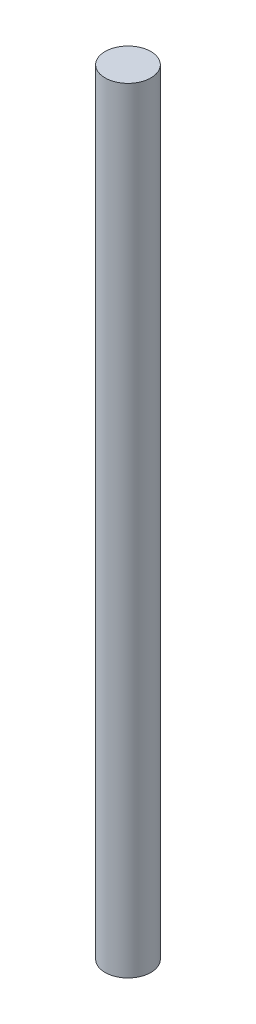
ISO-10303-21;
HEADER;
FILE_DESCRIPTION(('STEP AP214'),'2;1');
FILE_NAME('part.step','',(''),(''),'','','');
FILE_SCHEMA(('AUTOMOTIVE_DESIGN { 1 0 10303 214 1 1 1 1 }'));
ENDSEC;
DATA;
#1=APPLICATION_CONTEXT('core data for automotive mechanical design processes');
#2=APPLICATION_PROTOCOL_DEFINITION('international standard','automotive_design',2000,#1);
#3=PRODUCT_CONTEXT('',#1,'mechanical');
#4=PRODUCT('Part','Part','',(#3));
#5=PRODUCT_RELATED_PRODUCT_CATEGORY('part','',(#4));
#6=PRODUCT_DEFINITION_FORMATION('','',#4);
#7=PRODUCT_DEFINITION_CONTEXT('part definition',#1,'design');
#8=PRODUCT_DEFINITION('design','',#6,#7);
#9=PRODUCT_DEFINITION_SHAPE('','',#8);
#10=(LENGTH_UNIT() NAMED_UNIT(*) SI_UNIT(.MILLI.,.METRE.));
#11=(NAMED_UNIT(*) PLANE_ANGLE_UNIT() SI_UNIT($,.RADIAN.));
#12=(NAMED_UNIT(*) SI_UNIT($,.STERADIAN.) SOLID_ANGLE_UNIT());
#13=UNCERTAINTY_MEASURE_WITH_UNIT(LENGTH_MEASURE(1.E-05),#10,'distance_accuracy_value','');
#14=(GEOMETRIC_REPRESENTATION_CONTEXT(3) GLOBAL_UNCERTAINTY_ASSIGNED_CONTEXT((#13)) GLOBAL_UNIT_ASSIGNED_CONTEXT((#10,
#11,#12)) REPRESENTATION_CONTEXT('',''));
#15=CARTESIAN_POINT('',(0.,0.,0.));
#16=DIRECTION('',(0.,0.,1.));
#17=DIRECTION('',(1.,0.,0.));
#18=AXIS2_PLACEMENT_3D('',#15,#16,#17);
#19=CARTESIAN_POINT('',(0.,66.,0.));
#20=DIRECTION('',(0.,-1.,0.));
#21=DIRECTION('',(0.,0.,-1.));
#22=AXIS2_PLACEMENT_3D('',#19,#20,#21);
#23=CYLINDRICAL_SURFACE('',#22,1.95);
#24=CARTESIAN_POINT('',(0.,66.,0.));
#25=DIRECTION('',(0.,1.,0.));
#26=DIRECTION('',(0.,0.,1.));
#27=AXIS2_PLACEMENT_3D('',#24,#25,#26);
#28=CIRCLE('',#27,1.95);
#29=CARTESIAN_POINT('',(0.,66.,1.95));
#30=VERTEX_POINT('',#29);
#31=EDGE_CURVE('E10',#30,#30,#28,.T.);
#32=ORIENTED_EDGE('',*,*,#31,.F.);
#33=EDGE_LOOP('',(#32));
#34=FACE_BOUND('',#33,.T.);
#35=CARTESIAN_POINT('',(0.,0.,0.));
#36=DIRECTION('',(0.,1.,0.));
#37=DIRECTION('',(0.,0.,1.));
#38=AXIS2_PLACEMENT_3D('',#35,#36,#37);
#39=CIRCLE('',#38,1.95);
#40=CARTESIAN_POINT('',(0.,0.,1.95));
#41=VERTEX_POINT('',#40);
#42=EDGE_CURVE('E36',#41,#41,#39,.T.);
#43=ORIENTED_EDGE('',*,*,#42,.T.);
#44=EDGE_LOOP('',(#43));
#45=FACE_BOUND('',#44,.T.);
#46=ADVANCED_FACE('F33',(#34,#45),#23,.T.);
#47=CARTESIAN_POINT('',(0.,66.,0.));
#48=DIRECTION('',(0.,1.,0.));
#49=DIRECTION('',(0.,0.,1.));
#50=AXIS2_PLACEMENT_3D('',#47,#48,#49);
#51=PLANE('',#50);
#52=ORIENTED_EDGE('',*,*,#31,.T.);
#53=EDGE_LOOP('',(#52));
#54=FACE_BOUND('',#53,.T.);
#55=ADVANCED_FACE('F48',(#54),#51,.T.);
#56=CARTESIAN_POINT('',(0.,0.,0.));
#57=DIRECTION('',(0.,1.,0.));
#58=DIRECTION('',(0.,0.,1.));
#59=AXIS2_PLACEMENT_3D('',#56,#57,#58);
#60=PLANE('',#59);
#61=ORIENTED_EDGE('',*,*,#42,.F.);
#62=EDGE_LOOP('',(#61));
#63=FACE_BOUND('',#62,.T.);
#64=ADVANCED_FACE('F46',(#63),#60,.F.);
#65=CLOSED_SHELL('',(#46,#55,#64));
#66=MANIFOLD_SOLID_BREP('B2',#65);
#67=ADVANCED_BREP_SHAPE_REPRESENTATION('',(#18,#66),#14);
#68=SHAPE_DEFINITION_REPRESENTATION(#9,#67);
ENDSEC;
END-ISO-10303-21;
